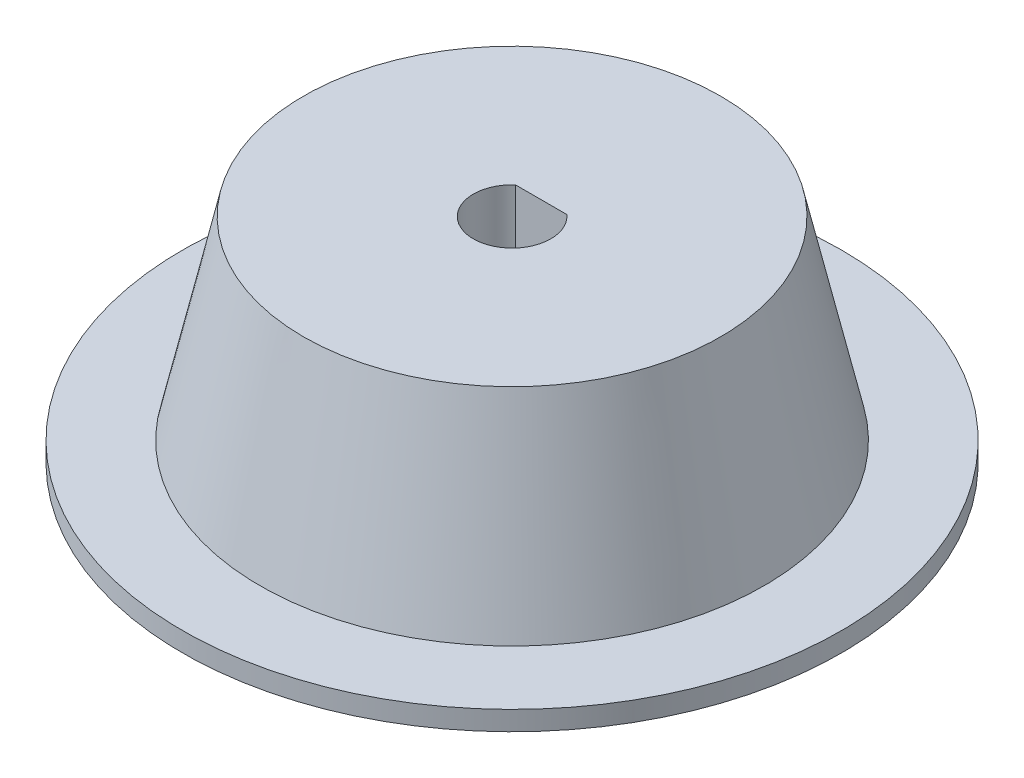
ISO-10303-21;
HEADER;
FILE_DESCRIPTION(('STEP AP214'),'2;1');
FILE_NAME('part.step','',(''),(''),'','','');
FILE_SCHEMA(('AUTOMOTIVE_DESIGN { 1 0 10303 214 1 1 1 1 }'));
ENDSEC;
DATA;
#1=APPLICATION_CONTEXT('core data for automotive mechanical design processes');
#2=APPLICATION_PROTOCOL_DEFINITION('international standard','automotive_design',2000,#1);
#3=PRODUCT_CONTEXT('',#1,'mechanical');
#4=PRODUCT('Part','Part','',(#3));
#5=PRODUCT_RELATED_PRODUCT_CATEGORY('part','',(#4));
#6=PRODUCT_DEFINITION_FORMATION('','',#4);
#7=PRODUCT_DEFINITION_CONTEXT('part definition',#1,'design');
#8=PRODUCT_DEFINITION('design','',#6,#7);
#9=PRODUCT_DEFINITION_SHAPE('','',#8);
#10=(LENGTH_UNIT() NAMED_UNIT(*) SI_UNIT(.MILLI.,.METRE.));
#11=(NAMED_UNIT(*) PLANE_ANGLE_UNIT() SI_UNIT($,.RADIAN.));
#12=(NAMED_UNIT(*) SI_UNIT($,.STERADIAN.) SOLID_ANGLE_UNIT());
#13=UNCERTAINTY_MEASURE_WITH_UNIT(LENGTH_MEASURE(1.E-05),#10,'distance_accuracy_value','');
#14=(GEOMETRIC_REPRESENTATION_CONTEXT(3) GLOBAL_UNCERTAINTY_ASSIGNED_CONTEXT((#13)) GLOBAL_UNIT_ASSIGNED_CONTEXT((#10,
#11,#12)) REPRESENTATION_CONTEXT('',''));
#15=CARTESIAN_POINT('',(0.,0.,0.));
#16=DIRECTION('',(0.,0.,1.));
#17=DIRECTION('',(1.,0.,0.));
#18=AXIS2_PLACEMENT_3D('',#15,#16,#17);
#19=CARTESIAN_POINT('',(0.,10.,0.));
#20=DIRECTION('',(0.,1.,0.));
#21=DIRECTION('',(0.,0.,1.));
#22=AXIS2_PLACEMENT_3D('',#19,#20,#21);
#23=PLANE('',#22);
#24=CARTESIAN_POINT('',(0.,10.,0.));
#25=DIRECTION('',(0.,-1.,0.));
#26=DIRECTION('',(0.,0.,-1.));
#27=AXIS2_PLACEMENT_3D('',#24,#25,#26);
#28=CIRCLE('',#27,10.7574038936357);
#29=CARTESIAN_POINT('',(0.,10.,-10.7574038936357));
#30=VERTEX_POINT('',#29);
#31=EDGE_CURVE('E11',#30,#30,#28,.T.);
#32=ORIENTED_EDGE('',*,*,#31,.F.);
#33=EDGE_LOOP('',(#32));
#34=FACE_BOUND('',#33,.T.);
#35=CARTESIAN_POINT('',(0.,10.,0.));
#36=DIRECTION('',(0.,1.,0.));
#37=DIRECTION('',(0.,0.,1.));
#38=AXIS2_PLACEMENT_3D('',#35,#36,#37);
#39=CIRCLE('',#38,2.);
#40=CARTESIAN_POINT('',(-1.3228756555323,10.,-1.5));
#41=VERTEX_POINT('',#40);
#42=CARTESIAN_POINT('',(1.3228756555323,10.,-1.5));
#43=VERTEX_POINT('',#42);
#44=EDGE_CURVE('E85',#41,#43,#39,.T.);
#45=ORIENTED_EDGE('',*,*,#44,.F.);
#46=DIRECTION('',(1.,0.,0.));
#47=VECTOR('',#46,1.);
#48=CARTESIAN_POINT('',(0.,10.,-1.5));
#49=LINE('',#48,#47);
#50=EDGE_CURVE('E64',#41,#43,#49,.T.);
#51=ORIENTED_EDGE('',*,*,#50,.T.);
#52=EDGE_LOOP('',(#45,#51));
#53=FACE_BOUND('',#52,.T.);
#54=ADVANCED_FACE('F49',(#34,#53),#23,.T.);
#55=CARTESIAN_POINT('',(0.,-1.,0.));
#56=DIRECTION('',(0.,-1.,0.));
#57=DIRECTION('',(0.,0.,-1.));
#58=AXIS2_PLACEMENT_3D('',#55,#56,#57);
#59=PLANE('',#58);
#60=CARTESIAN_POINT('',(0.,-1.,0.));
#61=DIRECTION('',(0.,-1.,0.));
#62=DIRECTION('',(0.,0.,-1.));
#63=AXIS2_PLACEMENT_3D('',#60,#61,#62);
#64=CIRCLE('',#63,17.);
#65=CARTESIAN_POINT('',(0.,-1.,-17.));
#66=VERTEX_POINT('',#65);
#67=EDGE_CURVE('E98',#66,#66,#64,.T.);
#68=ORIENTED_EDGE('',*,*,#67,.T.);
#69=EDGE_LOOP('',(#68));
#70=FACE_BOUND('',#69,.T.);
#71=CARTESIAN_POINT('',(0.,-0.999999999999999,0.));
#72=DIRECTION('',(0.,1.,0.));
#73=DIRECTION('',(0.,0.,1.));
#74=AXIS2_PLACEMENT_3D('',#71,#72,#73);
#75=CIRCLE('',#74,2.);
#76=CARTESIAN_POINT('',(-1.3228756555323,-0.999999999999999,-1.5));
#77=VERTEX_POINT('',#76);
#78=CARTESIAN_POINT('',(1.3228756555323,-1.,-1.5));
#79=VERTEX_POINT('',#78);
#80=EDGE_CURVE('E93',#77,#79,#75,.T.);
#81=ORIENTED_EDGE('',*,*,#80,.T.);
#82=DIRECTION('',(1.,0.,0.));
#83=VECTOR('',#82,1.);
#84=CARTESIAN_POINT('',(0.,-0.999999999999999,-1.5));
#85=LINE('',#84,#83);
#86=EDGE_CURVE('E78',#77,#79,#85,.T.);
#87=ORIENTED_EDGE('',*,*,#86,.F.);
#88=EDGE_LOOP('',(#81,#87));
#89=FACE_BOUND('',#88,.T.);
#90=ADVANCED_FACE('F114',(#70,#89),#59,.T.);
#91=CARTESIAN_POINT('',(0.,0.,0.));
#92=DIRECTION('',(0.,-1.,0.));
#93=DIRECTION('',(0.,0.,-1.));
#94=AXIS2_PLACEMENT_3D('',#91,#92,#93);
#95=CONICAL_SURFACE('',#94,13.,0.220609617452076);
#96=ORIENTED_EDGE('',*,*,#31,.T.);
#97=EDGE_LOOP('',(#96));
#98=FACE_BOUND('',#97,.T.);
#99=CARTESIAN_POINT('',(0.,0.,0.));
#100=DIRECTION('',(0.,-1.,0.));
#101=DIRECTION('',(0.,0.,-1.));
#102=AXIS2_PLACEMENT_3D('',#99,#100,#101);
#103=CIRCLE('',#102,13.);
#104=CARTESIAN_POINT('',(0.,0.,-13.));
#105=VERTEX_POINT('',#104);
#106=EDGE_CURVE('E57',#105,#105,#103,.T.);
#107=ORIENTED_EDGE('',*,*,#106,.F.);
#108=EDGE_LOOP('',(#107));
#109=FACE_BOUND('',#108,.T.);
#110=ADVANCED_FACE('F111',(#98,#109),#95,.T.);
#111=CARTESIAN_POINT('',(0.,-1.,0.));
#112=DIRECTION('',(0.,1.,0.));
#113=DIRECTION('',(0.,0.,1.));
#114=AXIS2_PLACEMENT_3D('',#111,#112,#113);
#115=CYLINDRICAL_SURFACE('',#114,17.);
#116=ORIENTED_EDGE('',*,*,#67,.F.);
#117=EDGE_LOOP('',(#116));
#118=FACE_BOUND('',#117,.T.);
#119=CARTESIAN_POINT('',(0.,0.,0.));
#120=DIRECTION('',(0.,-1.,0.));
#121=DIRECTION('',(0.,0.,-1.));
#122=AXIS2_PLACEMENT_3D('',#119,#120,#121);
#123=CIRCLE('',#122,17.);
#124=CARTESIAN_POINT('',(0.,0.,-17.));
#125=VERTEX_POINT('',#124);
#126=EDGE_CURVE('E81',#125,#125,#123,.T.);
#127=ORIENTED_EDGE('',*,*,#126,.T.);
#128=EDGE_LOOP('',(#127));
#129=FACE_BOUND('',#128,.T.);
#130=ADVANCED_FACE('F113',(#118,#129),#115,.T.);
#131=CARTESIAN_POINT('',(0.,0.,0.));
#132=DIRECTION('',(0.,-1.,0.));
#133=DIRECTION('',(0.,0.,-1.));
#134=AXIS2_PLACEMENT_3D('',#131,#132,#133);
#135=PLANE('',#134);
#136=ORIENTED_EDGE('',*,*,#106,.T.);
#137=EDGE_LOOP('',(#136));
#138=FACE_BOUND('',#137,.T.);
#139=ORIENTED_EDGE('',*,*,#126,.F.);
#140=EDGE_LOOP('',(#139));
#141=FACE_BOUND('',#140,.T.);
#142=ADVANCED_FACE('F108',(#138,#141),#135,.F.);
#143=CARTESIAN_POINT('',(0.,-0.999999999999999,-1.5));
#144=DIRECTION('',(0.,0.,1.));
#145=DIRECTION('',(1.,0.,0.));
#146=AXIS2_PLACEMENT_3D('',#143,#144,#145);
#147=PLANE('',#146);
#148=ORIENTED_EDGE('',*,*,#50,.F.);
#149=DIRECTION('',(0.,1.,0.));
#150=VECTOR('',#149,1.);
#151=CARTESIAN_POINT('',(-1.3228756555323,-0.999999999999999,-1.5));
#152=LINE('',#151,#150);
#153=EDGE_CURVE('E82',#77,#41,#152,.T.);
#154=ORIENTED_EDGE('',*,*,#153,.F.);
#155=ORIENTED_EDGE('',*,*,#86,.T.);
#156=DIRECTION('',(0.,1.,0.));
#157=VECTOR('',#156,1.);
#158=CARTESIAN_POINT('',(1.3228756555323,-0.999999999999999,-1.5));
#159=LINE('',#158,#157);
#160=EDGE_CURVE('E71',#79,#43,#159,.T.);
#161=ORIENTED_EDGE('',*,*,#160,.T.);
#162=EDGE_LOOP('',(#148,#154,#155,#161));
#163=FACE_BOUND('',#162,.T.);
#164=ADVANCED_FACE('F76',(#163),#147,.T.);
#165=CARTESIAN_POINT('',(0.,-0.999999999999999,0.));
#166=DIRECTION('',(0.,1.,0.));
#167=DIRECTION('',(0.,0.,1.));
#168=AXIS2_PLACEMENT_3D('',#165,#166,#167);
#169=CYLINDRICAL_SURFACE('',#168,2.);
#170=ORIENTED_EDGE('',*,*,#44,.T.);
#171=ORIENTED_EDGE('',*,*,#160,.F.);
#172=ORIENTED_EDGE('',*,*,#80,.F.);
#173=ORIENTED_EDGE('',*,*,#153,.T.);
#174=EDGE_LOOP('',(#170,#171,#172,#173));
#175=FACE_BOUND('',#174,.T.);
#176=ADVANCED_FACE('F86',(#175),#169,.F.);
#177=CLOSED_SHELL('',(#54,#90,#110,#130,#142,#164,#176));
#178=MANIFOLD_SOLID_BREP('B2',#177);
#179=ADVANCED_BREP_SHAPE_REPRESENTATION('',(#18,#178),#14);
#180=SHAPE_DEFINITION_REPRESENTATION(#9,#179);
ENDSEC;
END-ISO-10303-21;
